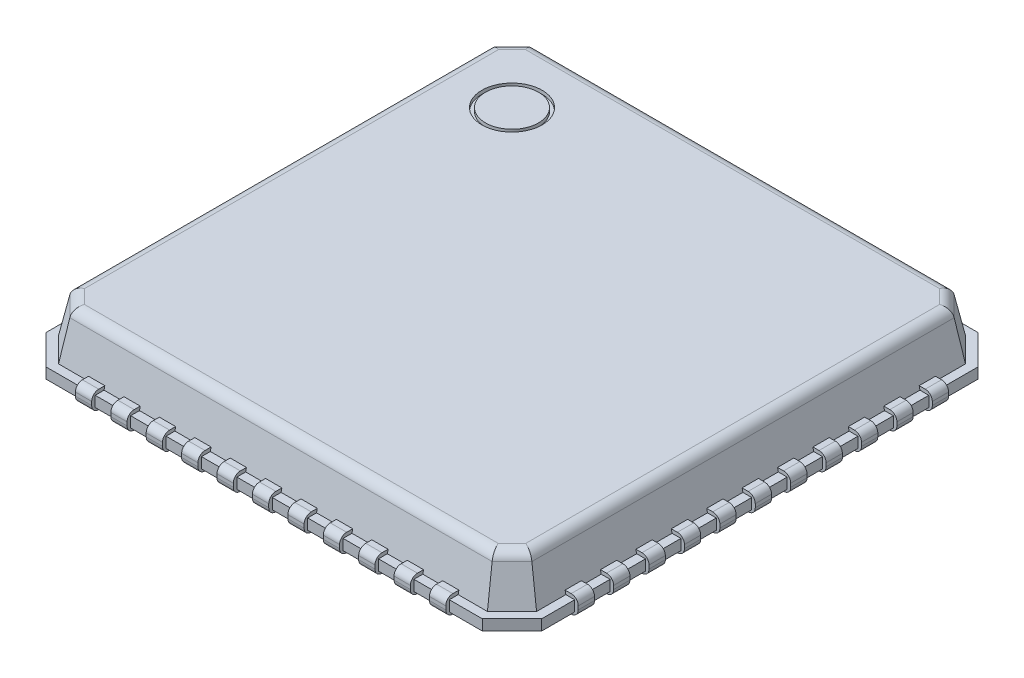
from build123d import *

# Parameters (mm, degrees)
EXTRUDE_START                  = 0.05
EXTRUDE_1_DEPTH                = 0.15
EXTRUDE_2_DEPTH                = 0.65
EXTRUDE_2_TAPER                = 12
EXTRUDE_3_DEPTH                = 0.115
FILLET_2_R                     = 0.1
EXTRUDE_4_DEPTH                = 0.115
FILLET_1_R                     = 0.1
FILLET_3_R                     = 0.15
SKETCH_5_R                     = 0.425
SKETCH_5_R_2                   = 0.375
CUT_EXTRUDE_1_DEPTH            = 0.05
PATTERN_LINEAR_1_COUNT         = 11
PATTERN_LINEAR_1_PITCH         = 0.5
FILLET_2_OF_PATTERN_LINEAR_1_R = 0.1
PATTERN_LINEAR_2_COUNT         = 11
PATTERN_LINEAR_2_PITCH         = 0.5
FILLET_1_OF_PATTERN_LINEAR_2_R = 0.1
EXTRUDE_5_DEPTH                = 0.05


with BuildPart() as part:
    # Sketch 1 → Extrude 1 (new body)
    with BuildSketch(Plane(origin=(0, 0, 0), x_dir=(1, 0, 0), z_dir=(0, 1, 0)).offset(EXTRUDE_START)):
        Polygon((-3.5, 3.08), (-3.08, 3.5), (3.08, 3.5), (3.5, 3.08), (3.5, -3.08), (3.08, -3.5), (-3.08, -3.5), (-3.5, -3.08), align=None)
    extrude(amount=EXTRUDE_1_DEPTH)

    # Sketch 2 → Extrude 2 (add)
    with BuildSketch(Plane(origin=(0, 0.2, 0), x_dir=(-1, 0, 0), z_dir=(0, 1, 0))):
        Polygon((3.028223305, -3.375), (3.375, -3.028223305), (3.375, 3.028223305), (3.028223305, 3.375), (-3.028223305, 3.375), (-3.375, 3.028223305), (-3.375, -3.028223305), (-3.028223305, -3.375), align=None)
    extrude(amount=EXTRUDE_2_DEPTH, taper=EXTRUDE_2_TAPER)

    # Sketch 3 → Extrude 3 (add, symmetric)
    with BuildSketch(Plane.XY.offset(-2.5)):
        with BuildLine():
            Line((-3.45, 0.25), (-3.08, 0.25))
            Line((-3.08, 0.25), (-3.08, 0))
            Line((-3.08, 0), (-3.45, 0))
            ThreePointArc((-3.45, 0), (-3.520710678, 0.029289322), (-3.55, 0.1))
            Line((-3.55, 0.1), (-3.55, 0.15))
            ThreePointArc((-3.55, 0.15), (-3.520710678, 0.220710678), (-3.45, 0.25))
        make_face()
        with BuildLine():
            Line((3.08, 0.25), (3.45, 0.25))
            ThreePointArc((3.45, 0.25), (3.520710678, 0.220710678), (3.55, 0.15))
            Line((3.55, 0.15), (3.55, 0.1))
            ThreePointArc((3.55, 0.1), (3.520710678, 0.029289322), (3.45, 0))
            Line((3.45, 0), (3.08, 0))
            Line((3.08, 0), (3.08, 0.25))
        make_face()
    extrude_3 = extrude(amount=EXTRUDE_3_DEPTH, both=True)

    # Fillet 2
    fillet_2_edges = [part.edges().sort_by_distance(p)[0] for p in [
        (-3.08, 0.025, -2.615),
        (-3.08, 0.025, -2.385),
        (3.08, 0.025, -2.615),
        (3.08, 0.025, -2.385),
    ]]
    fillet(fillet_2_edges, radius=FILLET_2_R)

    # Sketch 4 → Extrude 4 (add, symmetric)
    with BuildSketch(Plane(origin=(-2.5, 0, 0), x_dir=(0, 0, -1), z_dir=(1, 0, 0))):
        with BuildLine():
            Line((3.08, 0.25), (3.45, 0.25))
            ThreePointArc((3.45, 0.25), (3.520710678, 0.220710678), (3.55, 0.15))
            Line((3.55, 0.15), (3.55, 0.1))
            ThreePointArc((3.55, 0.1), (3.520710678, 0.029289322), (3.45, 0))
            Line((3.45, 0), (3.08, 0))
            Line((3.08, 0), (3.08, 0.25))
        make_face()
        with BuildLine():
            Line((-3.45, 0.25), (-3.08, 0.25))
            Line((-3.08, 0.25), (-3.08, 0))
            Line((-3.08, 0), (-3.45, 0))
            ThreePointArc((-3.45, 0), (-3.520710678, 0.029289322), (-3.55, 0.1))
            Line((-3.55, 0.1), (-3.55, 0.15))
            ThreePointArc((-3.55, 0.15), (-3.520710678, 0.220710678), (-3.45, 0.25))
        make_face()
    extrude_4 = extrude(amount=EXTRUDE_4_DEPTH, both=True)

    # Fillet 1
    fillet_1_edges = [part.edges().sort_by_distance(p)[0] for p in [
        (-2.615, 0.025, -3.08),
        (-2.385, 0.025, -3.08),
        (-2.615, 0.025, 3.08),
        (-2.385, 0.025, 3.08),
    ]]
    fillet(fillet_1_edges, radius=FILLET_1_R)

    # Fillet 3
    fillet_3_edges = [part.edges().sort_by_distance(p)[0] for p in [
        (3.103916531, 0.85, -3.103916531),
        (0, 0.85, -3.236838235),
        (-3.103916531, 0.85, -3.103916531),
        (-3.236838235, 0.85, 0),
        (-3.103916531, 0.85, 3.103916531),
        (0, 0.85, 3.236838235),
        (3.103916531, 0.85, 3.103916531),
        (3.236838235, 0.85, 0),
    ]]
    fillet(fillet_3_edges, radius=FILLET_3_R)

    # Sketch 5 → Cut-Extrude 1 (cut)
    with BuildSketch(Plane(origin=(0, 0.85, 0), x_dir=(-1, 0, 0), z_dir=(0, 1, 0))):
        with Locations((2.310919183, -2.310919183)):
            Circle(SKETCH_5_R)
        with Locations((2.310919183, -2.310919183)):
            Circle(SKETCH_5_R_2, mode=Mode.SUBTRACT)
    extrude(amount=-CUT_EXTRUDE_1_DEPTH, mode=Mode.SUBTRACT)

    # Pattern Linear 1: Extrude 3 ×11
    with Locations(*[(0, 0, i * PATTERN_LINEAR_1_PITCH) for i in range(1, PATTERN_LINEAR_1_COUNT)]):
        add(extrude_3)

    # Fillet 2 of Pattern Linear 1
    fillet_2_of_pattern_linear_1_edges = [part.edges().sort_by_distance(p)[0] for p in [
        (-3.08, 0.025, -2.115),
        (-3.08, 0.025, -1.885),
        (3.08, 0.025, -2.115),
        (3.08, 0.025, -1.885),
        (-3.08, 0.025, -1.615),
        (-3.08, 0.025, -1.385),
        (3.08, 0.025, -1.615),
        (3.08, 0.025, -1.385),
        (-3.08, 0.025, -1.115),
        (-3.08, 0.025, -0.885),
        (3.08, 0.025, -1.115),
        (3.08, 0.025, -0.885),
        (-3.08, 0.025, -0.615),
        (-3.08, 0.025, -0.385),
        (3.08, 0.025, -0.615),
        (3.08, 0.025, -0.385),
        (-3.08, 0.025, -0.115),
        (-3.08, 0.025, 0.115),
        (3.08, 0.025, -0.115),
        (3.08, 0.025, 0.115),
        (-3.08, 0.025, 0.385),
        (-3.08, 0.025, 0.615),
        (3.08, 0.025, 0.385),
        (3.08, 0.025, 0.615),
        (-3.08, 0.025, 0.885),
        (-3.08, 0.025, 1.115),
        (3.08, 0.025, 0.885),
        (3.08, 0.025, 1.115),
        (-3.08, 0.025, 1.385),
        (-3.08, 0.025, 1.615),
        (3.08, 0.025, 1.385),
        (3.08, 0.025, 1.615),
        (-3.08, 0.025, 1.885),
        (-3.08, 0.025, 2.115),
        (3.08, 0.025, 1.885),
        (3.08, 0.025, 2.115),
        (-3.08, 0.025, 2.385),
        (-3.08, 0.025, 2.615),
        (3.08, 0.025, 2.385),
        (3.08, 0.025, 2.615),
    ]]
    fillet(fillet_2_of_pattern_linear_1_edges, radius=FILLET_2_OF_PATTERN_LINEAR_1_R)

    # Pattern Linear 2: Extrude 4 ×11
    with Locations(*[(i * PATTERN_LINEAR_2_PITCH, 0, 0) for i in range(1, PATTERN_LINEAR_2_COUNT)]):
        add(extrude_4)

    # Fillet 1 of Pattern Linear 2
    fillet_1_of_pattern_linear_2_edges = [part.edges().sort_by_distance(p)[0] for p in [
        (-2.115, 0.025, -3.08),
        (-1.885, 0.025, -3.08),
        (-2.115, 0.025, 3.08),
        (-1.885, 0.025, 3.08),
        (-1.615, 0.025, -3.08),
        (-1.385, 0.025, -3.08),
        (-1.615, 0.025, 3.08),
        (-1.385, 0.025, 3.08),
        (-1.115, 0.025, -3.08),
        (-0.885, 0.025, -3.08),
        (-1.115, 0.025, 3.08),
        (-0.885, 0.025, 3.08),
        (-0.615, 0.025, -3.08),
        (-0.385, 0.025, -3.08),
        (-0.615, 0.025, 3.08),
        (-0.385, 0.025, 3.08),
        (-0.115, 0.025, -3.08),
        (0.115, 0.025, -3.08),
        (-0.115, 0.025, 3.08),
        (0.115, 0.025, 3.08),
        (0.385, 0.025, -3.08),
        (0.615, 0.025, -3.08),
        (0.385, 0.025, 3.08),
        (0.615, 0.025, 3.08),
        (0.885, 0.025, -3.08),
        (1.115, 0.025, -3.08),
        (0.885, 0.025, 3.08),
        (1.115, 0.025, 3.08),
        (1.385, 0.025, -3.08),
        (1.615, 0.025, -3.08),
        (1.385, 0.025, 3.08),
        (1.615, 0.025, 3.08),
        (1.885, 0.025, -3.08),
        (2.115, 0.025, -3.08),
        (1.885, 0.025, 3.08),
        (2.115, 0.025, 3.08),
        (2.385, 0.025, -3.08),
        (2.615, 0.025, -3.08),
        (2.385, 0.025, 3.08),
        (2.615, 0.025, 3.08),
    ]]
    fillet(fillet_1_of_pattern_linear_2_edges, radius=FILLET_1_OF_PATTERN_LINEAR_2_R)

    # Sketch 6 → Extrude 5 (add)
    with BuildSketch(Plane.XZ.offset(-0.05)):
        with BuildLine():
            Line((-2.55, -2.3), (-2.55, -2.4))
            ThreePointArc((-2.55, -2.4), (-2.506066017, -2.506066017), (-2.4, -2.55))
            Line((-2.4, -2.55), (2.4, -2.55))
            ThreePointArc((2.4, -2.55), (2.506066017, -2.506066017), (2.55, -2.4))
            Line((2.55, -2.4), (2.55, 2.4))
            ThreePointArc((2.55, 2.4), (2.506066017, 2.506066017), (2.4, 2.55))
            Line((2.4, 2.55), (-2.4, 2.55))
            ThreePointArc((-2.4, 2.55), (-2.506066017, 2.506066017), (-2.55, 2.4))
            Line((-2.55, 2.4), (-2.55, -1.9))
            ThreePointArc((-2.55, -1.9), (-2.35, -2.1), (-2.55, -2.3))
        make_face()
    extrude(amount=EXTRUDE_5_DEPTH)


solid = part.part
